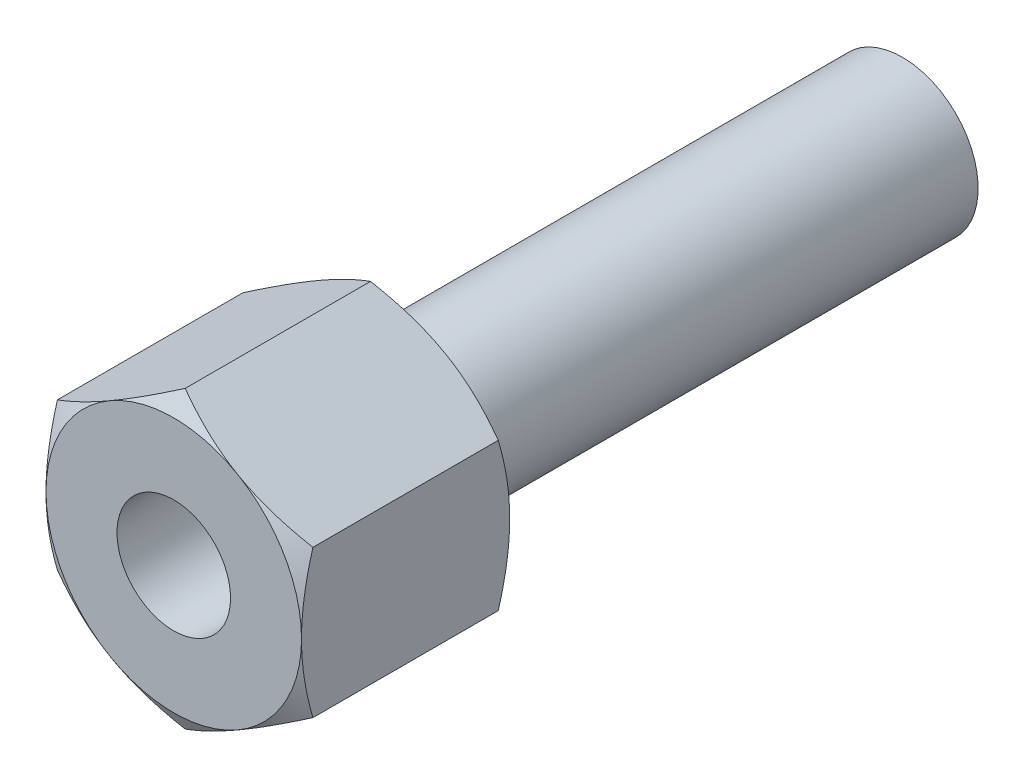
ISO-10303-21;
HEADER;
FILE_DESCRIPTION(('STEP AP214'),'2;1');
FILE_NAME('part.step','',(''),(''),'','','');
FILE_SCHEMA(('AUTOMOTIVE_DESIGN { 1 0 10303 214 1 1 1 1 }'));
ENDSEC;
DATA;
#1=APPLICATION_CONTEXT('core data for automotive mechanical design processes');
#2=APPLICATION_PROTOCOL_DEFINITION('international standard','automotive_design',2000,#1);
#3=PRODUCT_CONTEXT('',#1,'mechanical');
#4=PRODUCT('Part','Part','',(#3));
#5=PRODUCT_RELATED_PRODUCT_CATEGORY('part','',(#4));
#6=PRODUCT_DEFINITION_FORMATION('','',#4);
#7=PRODUCT_DEFINITION_CONTEXT('part definition',#1,'design');
#8=PRODUCT_DEFINITION('design','',#6,#7);
#9=PRODUCT_DEFINITION_SHAPE('','',#8);
#10=(LENGTH_UNIT() NAMED_UNIT(*) SI_UNIT(.MILLI.,.METRE.));
#11=(NAMED_UNIT(*) PLANE_ANGLE_UNIT() SI_UNIT($,.RADIAN.));
#12=(NAMED_UNIT(*) SI_UNIT($,.STERADIAN.) SOLID_ANGLE_UNIT());
#13=UNCERTAINTY_MEASURE_WITH_UNIT(LENGTH_MEASURE(1.E-05),#10,'distance_accuracy_value','');
#14=(GEOMETRIC_REPRESENTATION_CONTEXT(3) GLOBAL_UNCERTAINTY_ASSIGNED_CONTEXT((#13)) GLOBAL_UNIT_ASSIGNED_CONTEXT((#10,
#11,#12)) REPRESENTATION_CONTEXT('',''));
#15=CARTESIAN_POINT('',(0.,0.,0.));
#16=DIRECTION('',(0.,0.,1.));
#17=DIRECTION('',(1.,0.,0.));
#18=AXIS2_PLACEMENT_3D('',#15,#16,#17);
#19=CARTESIAN_POINT('',(0.,15.5884572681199,22.));
#20=DIRECTION('',(0.5,-0.866025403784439,0.));
#21=DIRECTION('',(0.866025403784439,0.5,0.));
#22=AXIS2_PLACEMENT_3D('',#19,#20,#21);
#23=PLANE('',#22);
#24=CARTESIAN_POINT('',(-13.5002,7.79411316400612,1.20583803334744));
#25=CARTESIAN_POINT('',(-13.2034751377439,7.9654273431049,1.10693600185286));
#26=CARTESIAN_POINT('',(-12.9055928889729,8.13740973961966,1.01252193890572));
#27=CARTESIAN_POINT('',(-12.3074397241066,8.48275363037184,0.833917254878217));
#28=CARTESIAN_POINT('',(-12.0071680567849,8.65611555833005,0.749729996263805));
#29=CARTESIAN_POINT('',(-11.403655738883,9.00455355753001,0.592710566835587));
#30=CARTESIAN_POINT('',(-11.1004098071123,9.17963267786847,0.51990526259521));
#31=CARTESIAN_POINT('',(-10.4918107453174,9.53100751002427,0.387213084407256));
#32=CARTESIAN_POINT('',(-10.1864577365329,9.70730315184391,0.327325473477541));
#33=CARTESIAN_POINT('',(-9.58146884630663,10.0565936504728,0.22301591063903));
#34=CARTESIAN_POINT('',(-9.28187788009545,10.2295625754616,0.178248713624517));
#35=CARTESIAN_POINT('',(-8.68132315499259,10.5762930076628,0.10318393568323));
#36=CARTESIAN_POINT('',(-8.38035936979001,10.7500545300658,0.0728866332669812));
#37=CARTESIAN_POINT('',(-7.77792621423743,11.0978694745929,0.0275266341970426));
#38=CARTESIAN_POINT('',(-7.47645787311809,11.2719223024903,0.0124458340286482));
#39=CARTESIAN_POINT('',(-6.87324289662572,11.6201886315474,-0.00215683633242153));
#40=CARTESIAN_POINT('',(-6.57149627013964,11.7944021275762,-0.00167918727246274));
#41=CARTESIAN_POINT('',(-6.00738189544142,12.1200937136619,0.0137483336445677));
#42=CARTESIAN_POINT('',(-5.74497394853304,12.271595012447,0.0268164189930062));
#43=CARTESIAN_POINT('',(-5.22076165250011,12.5742491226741,0.0644725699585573));
#44=CARTESIAN_POINT('',(-4.95895734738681,12.7254019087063,0.0890614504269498));
#45=CARTESIAN_POINT('',(-4.43609453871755,13.0272768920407,0.149330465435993));
#46=CARTESIAN_POINT('',(-4.17503683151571,13.1779986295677,0.185019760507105));
#47=CARTESIAN_POINT('',(-3.65414530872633,13.4787354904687,0.2668634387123));
#48=CARTESIAN_POINT('',(-3.39431157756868,13.6287505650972,0.313018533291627));
#49=CARTESIAN_POINT('',(-2.60557180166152,14.0841296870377,0.468349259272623));
#50=CARTESIAN_POINT('',(-2.07894982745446,14.3881750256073,0.593013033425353));
#51=CARTESIAN_POINT('',(-1.03355849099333,14.9917319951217,0.875948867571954));
#52=CARTESIAN_POINT('',(-0.514775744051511,15.2912513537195,1.03415447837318));
#53=CARTESIAN_POINT('',(0.00020000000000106,15.5885727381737,1.20583803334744));
#54=B_SPLINE_CURVE_WITH_KNOTS('',3,(#24,#25,#26,#27,#28,#29,#30,#31,#32,#33,#34,#35,#36,#37,#38,
#39,#40,#41,#42,#43,#44,#45,#46,#47,#48,#49,#50,#51,#52,#53),.UNSPECIFIED.,.F.,.F.,(4,2,2,2,2,2,
2,2,2,2,2,2,2,2,4),(0.,1.0698794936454,2.14010980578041,3.21282939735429,4.28548777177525,
5.33167033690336,6.37787303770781,7.42282956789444,8.46775380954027,9.377387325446,
10.2870851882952,11.1975357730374,12.1080482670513,13.9691139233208,15.8265265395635),.UNSPECIFIED.);
#55=CARTESIAN_POINT('',(-13.5,7.79422863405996,1.20577136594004));
#56=VERTEX_POINT('',#55);
#57=CARTESIAN_POINT('',(-6.75,11.6913429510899,0.));
#58=VERTEX_POINT('',#57);
#59=EDGE_CURVE('E135',#56,#58,#54,.T.);
#60=ORIENTED_EDGE('',*,*,#59,.F.);
#61=DIRECTION('',(0.,0.,-1.));
#62=VECTOR('',#61,1.);
#63=CARTESIAN_POINT('',(-13.5,7.79422863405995,22.));
#64=LINE('',#63,#62);
#65=CARTESIAN_POINT('',(-13.5,7.79422863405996,20.79422863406));
#66=VERTEX_POINT('',#65);
#67=EDGE_CURVE('E262',#66,#56,#64,.T.);
#68=ORIENTED_EDGE('',*,*,#67,.F.);
#69=CARTESIAN_POINT('',(0.0002,15.5885727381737,20.7941619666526));
#70=CARTESIAN_POINT('',(-0.296524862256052,15.417258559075,20.8930639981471));
#71=CARTESIAN_POINT('',(-0.594407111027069,15.2452761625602,20.9874780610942));
#72=CARTESIAN_POINT('',(-1.19256027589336,14.899932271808,21.1660827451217));
#73=CARTESIAN_POINT('',(-1.49283194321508,14.7265703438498,21.2502700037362));
#74=CARTESIAN_POINT('',(-2.09634426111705,14.3781323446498,21.4072894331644));
#75=CARTESIAN_POINT('',(-2.39959019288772,14.2030532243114,21.4800947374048));
#76=CARTESIAN_POINT('',(-3.00818925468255,13.8516783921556,21.6127869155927));
#77=CARTESIAN_POINT('',(-3.31354226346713,13.675382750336,21.6726745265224));
#78=CARTESIAN_POINT('',(-3.91853115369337,13.3260922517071,21.7769840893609));
#79=CARTESIAN_POINT('',(-4.21812211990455,13.1531233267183,21.8217512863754));
#80=CARTESIAN_POINT('',(-4.81867684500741,12.8063928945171,21.8968160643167));
#81=CARTESIAN_POINT('',(-5.11964063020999,12.632631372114,21.927113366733));
#82=CARTESIAN_POINT('',(-5.72207378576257,12.284816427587,21.9724733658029));
#83=CARTESIAN_POINT('',(-6.02354212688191,12.1107635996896,21.9875541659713));
#84=CARTESIAN_POINT('',(-6.62675710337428,11.7624972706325,22.0021568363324));
#85=CARTESIAN_POINT('',(-6.92850372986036,11.5882837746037,22.0016791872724));
#86=CARTESIAN_POINT('',(-7.49261810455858,11.262592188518,21.9862516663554));
#87=CARTESIAN_POINT('',(-7.75502605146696,11.1110908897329,21.973183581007));
#88=CARTESIAN_POINT('',(-8.27923834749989,10.8084367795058,21.9355274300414));
#89=CARTESIAN_POINT('',(-8.54104265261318,10.6572839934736,21.910938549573));
#90=CARTESIAN_POINT('',(-9.06390546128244,10.3554090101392,21.850669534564));
#91=CARTESIAN_POINT('',(-9.32496316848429,10.2046872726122,21.8149802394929));
#92=CARTESIAN_POINT('',(-9.84585469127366,9.90395041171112,21.7331365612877));
#93=CARTESIAN_POINT('',(-10.1056884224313,9.7539353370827,21.6869814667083));
#94=CARTESIAN_POINT('',(-10.8944281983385,9.29855621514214,21.5316507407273));
#95=CARTESIAN_POINT('',(-11.4210501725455,8.99451087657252,21.4069869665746));
#96=CARTESIAN_POINT('',(-12.4664415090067,8.39095390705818,21.124051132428));
#97=CARTESIAN_POINT('',(-12.9852242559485,8.09143454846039,20.9658455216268));
#98=CARTESIAN_POINT('',(-13.5002,7.79411316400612,20.7941619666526));
#99=B_SPLINE_CURVE_WITH_KNOTS('',3,(#69,#70,#71,#72,#73,#74,#75,#76,#77,#78,#79,#80,#81,#82,#83,
#84,#85,#86,#87,#88,#89,#90,#91,#92,#93,#94,#95,#96,#97,#98),.UNSPECIFIED.,.F.,.F.,(4,2,2,2,2,2,
2,2,2,2,2,2,2,2,4),(0.,1.0698794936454,2.14010980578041,3.21282939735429,4.28548777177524,
5.33167033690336,6.37787303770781,7.42282956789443,8.46775380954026,9.37738732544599,
10.2870851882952,11.1975357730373,12.1080482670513,13.9691139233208,15.8265265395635),.UNSPECIFIED.);
#100=CARTESIAN_POINT('',(-6.75,11.6913429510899,22.));
#101=VERTEX_POINT('',#100);
#102=EDGE_CURVE('E197',#101,#66,#99,.T.);
#103=ORIENTED_EDGE('',*,*,#102,.F.);
#104=CARTESIAN_POINT('',(0.,15.5884572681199,20.79422863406));
#105=VERTEX_POINT('',#104);
#106=EDGE_CURVE('E225',#105,#101,#99,.T.);
#107=ORIENTED_EDGE('',*,*,#106,.F.);
#108=DIRECTION('',(0.,0.,-1.));
#109=VECTOR('',#108,1.);
#110=CARTESIAN_POINT('',(0.,15.5884572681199,22.));
#111=LINE('',#110,#109);
#112=CARTESIAN_POINT('',(0.,15.5884572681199,1.20577136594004));
#113=VERTEX_POINT('',#112);
#114=EDGE_CURVE('E251',#105,#113,#111,.T.);
#115=ORIENTED_EDGE('',*,*,#114,.T.);
#116=EDGE_CURVE('E128',#58,#113,#54,.T.);
#117=ORIENTED_EDGE('',*,*,#116,.F.);
#118=EDGE_LOOP('',(#60,#68,#103,#107,#115,#117));
#119=FACE_BOUND('',#118,.T.);
#120=ADVANCED_FACE('F14',(#119),#23,.F.);
#121=CARTESIAN_POINT('',(-13.5,7.79422863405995,22.));
#122=DIRECTION('',(1.,0.,0.));
#123=DIRECTION('',(0.,0.,-1.));
#124=AXIS2_PLACEMENT_3D('',#121,#122,#123);
#125=PLANE('',#124);
#126=CARTESIAN_POINT('',(-13.5,-21.0567295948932,6.64686852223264));
#127=CARTESIAN_POINT('',(-13.5,-20.76141971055,6.50333975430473));
#128=CARTESIAN_POINT('',(-13.5,-20.4657665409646,6.36051762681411));
#129=CARTESIAN_POINT('',(-13.5,-19.8737020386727,6.07644645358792));
#130=CARTESIAN_POINT('',(-13.5,-19.5772906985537,5.93519742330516));
#131=CARTESIAN_POINT('',(-13.5,-18.6867347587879,5.51401322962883));
#132=CARTESIAN_POINT('',(-13.5,-18.0913537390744,5.23668263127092));
#133=CARTESIAN_POINT('',(-13.5,-16.8934647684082,4.68915362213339));
#134=CARTESIAN_POINT('',(-13.5,-16.290935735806,4.41900122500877));
#135=CARTESIAN_POINT('',(-13.5,-15.0811281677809,3.88958730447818));
#136=CARTESIAN_POINT('',(-13.5,-14.4738498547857,3.63032527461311));
#137=CARTESIAN_POINT('',(-13.5,-13.2334872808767,3.11725951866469));
#138=CARTESIAN_POINT('',(-13.5,-12.6002115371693,2.8639163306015));
#139=CARTESIAN_POINT('',(-13.5,-11.3262912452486,2.37611278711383));
#140=CARTESIAN_POINT('',(-13.5,-10.6856458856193,2.14165453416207));
#141=CARTESIAN_POINT('',(-13.5,-9.39714853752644,1.69769156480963));
#142=CARTESIAN_POINT('',(-13.5,-8.74931374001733,1.48813735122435));
#143=CARTESIAN_POINT('',(-13.5,-7.44429059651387,1.10061474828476));
#144=CARTESIAN_POINT('',(-13.5,-6.78710522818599,0.922636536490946));
#145=CARTESIAN_POINT('',(-13.5,-5.79602156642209,0.686222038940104));
#146=CARTESIAN_POINT('',(-13.5,-5.46570727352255,0.612672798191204));
#147=CARTESIAN_POINT('',(-13.5,-4.8027995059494,0.476621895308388));
#148=CARTESIAN_POINT('',(-13.5,-4.47020607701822,0.414120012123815));
#149=CARTESIAN_POINT('',(-13.5,-3.80296053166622,0.301259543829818));
#150=CARTESIAN_POINT('',(-13.5,-3.4683084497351,0.250900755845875));
#151=CARTESIAN_POINT('',(-13.5,-2.7972903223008,0.163326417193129));
#152=CARTESIAN_POINT('',(-13.5,-2.46092434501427,0.12611034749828));
#153=CARTESIAN_POINT('',(-13.5,-1.79139242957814,0.0660341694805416));
#154=CARTESIAN_POINT('',(-13.5,-1.45824305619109,0.0429905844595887));
#155=CARTESIAN_POINT('',(-13.5,-0.791268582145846,0.0110189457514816));
#156=CARTESIAN_POINT('',(-13.5,-0.457443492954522,0.00209065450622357));
#157=CARTESIAN_POINT('',(-13.5,0.210285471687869,-0.00143754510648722));
#158=CARTESIAN_POINT('',(-13.5,0.544189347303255,0.00396257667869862));
#159=CARTESIAN_POINT('',(-13.5,1.21146913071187,0.0289579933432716));
#160=CARTESIAN_POINT('',(-13.5,1.54484501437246,0.0485539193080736));
#161=CARTESIAN_POINT('',(-13.5,2.34243421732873,0.111999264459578));
#162=CARTESIAN_POINT('',(-13.5,2.80613715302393,0.162382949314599));
#163=CARTESIAN_POINT('',(-13.5,3.73018327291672,0.287899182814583));
#164=CARTESIAN_POINT('',(-13.5,4.19052600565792,0.363034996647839));
#165=CARTESIAN_POINT('',(-13.5,5.1073852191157,0.535382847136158));
#166=CARTESIAN_POINT('',(-13.5,5.5638984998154,0.632611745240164));
#167=CARTESIAN_POINT('',(-13.5,6.47238584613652,0.846171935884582));
#168=CARTESIAN_POINT('',(-13.5,6.92435997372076,0.962502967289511));
#169=CARTESIAN_POINT('',(-13.5,7.83377493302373,1.21419730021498));
#170=CARTESIAN_POINT('',(-13.5,8.29111385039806,1.34992628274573));
#171=CARTESIAN_POINT('',(-13.5,9.20128820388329,1.63564966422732));
#172=CARTESIAN_POINT('',(-13.5,9.65412360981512,1.7856441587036));
#173=CARTESIAN_POINT('',(-13.5,10.5555104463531,2.09749590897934));
#174=CARTESIAN_POINT('',(-13.5,11.004063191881,2.25934938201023));
#175=CARTESIAN_POINT('',(-13.5,11.8974359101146,2.59299128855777));
#176=CARTESIAN_POINT('',(-13.5,12.3422559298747,2.76477959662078));
#177=CARTESIAN_POINT('',(-13.5,13.4044984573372,3.18648515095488));
#178=CARTESIAN_POINT('',(-13.5,14.0203518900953,3.44034916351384));
#179=CARTESIAN_POINT('',(-13.5,15.2466947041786,3.96075653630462));
#180=CARTESIAN_POINT('',(-13.5,15.8571837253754,4.22730074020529));
#181=CARTESIAN_POINT('',(-13.5,17.0738155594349,4.77048959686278));
#182=CARTESIAN_POINT('',(-13.5,17.6799572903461,5.04713666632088));
#183=CARTESIAN_POINT('',(-13.5,18.8884850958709,5.60845922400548));
#184=CARTESIAN_POINT('',(-13.5,19.4908712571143,5.89313452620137));
#185=CARTESIAN_POINT('',(-13.5,20.6932151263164,6.46932231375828));
#186=CARTESIAN_POINT('',(-13.5,21.2931692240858,6.76084231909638));
#187=CARTESIAN_POINT('',(-13.5,22.4904551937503,7.34921758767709));
#188=CARTESIAN_POINT('',(-13.5,23.0877870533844,7.64607287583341));
#189=CARTESIAN_POINT('',(-13.5,24.2801545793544,8.24414991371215));
#190=CARTESIAN_POINT('',(-13.5,24.8751905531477,8.54537105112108));
#191=CARTESIAN_POINT('',(-13.5,26.0633848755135,9.15149610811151));
#192=CARTESIAN_POINT('',(-13.5,26.6565432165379,9.45640004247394));
#193=CARTESIAN_POINT('',(-13.5,28.3317379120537,10.323032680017));
#194=CARTESIAN_POINT('',(-13.5,29.411904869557,10.8883747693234));
#195=CARTESIAN_POINT('',(-13.5,31.5682242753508,12.0267442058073));
#196=CARTESIAN_POINT('',(-13.5,32.6443765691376,12.5997718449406));
#197=CARTESIAN_POINT('',(-13.5,34.7907289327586,13.7501918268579));
#198=CARTESIAN_POINT('',(-13.5,35.8609372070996,14.32756887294));
#199=CARTESIAN_POINT('',(-13.5,37.4643622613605,15.1970374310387));
#200=CARTESIAN_POINT('',(-13.5,37.9985075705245,15.4874191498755));
#201=CARTESIAN_POINT('',(-13.5,39.0662412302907,16.0692028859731));
#202=CARTESIAN_POINT('',(-13.5,39.5998295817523,16.3606049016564));
#203=CARTESIAN_POINT('',(-13.5,40.1331712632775,16.6524578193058));
#204=B_SPLINE_CURVE_WITH_KNOTS('',3,(#126,#127,#128,#129,#130,#131,#132,#133,#134,#135,#136,
#137,#138,#139,#140,#141,#142,#143,#144,#145,#146,#147,#148,#149,#150,#151,#152,#153,#154,#155,
#156,#157,#158,#159,#160,#161,#162,#163,#164,#165,#166,#167,#168,#169,#170,#171,#172,#173,#174,
#175,#176,#177,#178,#179,#180,#181,#182,#183,#184,#185,#186,#187,#188,#189,#190,#191,#192,#193,
#194,#195,#196,#197,#198,#199,#200,#201,#202,#203),.UNSPECIFIED.,.F.,.F.,(4,2,2,2,2,2,2,2,2,2,2,
2,2,2,2,2,2,2,2,2,2,2,2,2,2,2,2,2,2,2,2,2,2,2,2,2,2,2,4),(0.,0.985024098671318,1.97005786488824,
3.94041071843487,5.92128906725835,7.90207519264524,9.94805838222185,11.9942690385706,
14.036342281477,16.0777791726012,17.092835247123,18.1078710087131,19.12288981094,
20.1378685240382,21.1394144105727,22.1409434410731,23.1424745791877,24.1440502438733,
25.5425754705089,26.9412852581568,28.3410661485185,29.7408279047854,31.1717145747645,
32.6026108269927,34.0330526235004,35.4634763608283,37.4616565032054,39.4599697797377,
41.4587642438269,43.4575124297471,45.4585700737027,47.4596370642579,49.4604260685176,
51.4612231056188,55.11868221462,58.7762806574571,62.4243321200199,64.2482542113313,
66.0721734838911),.UNSPECIFIED.);
#205=CARTESIAN_POINT('',(-13.5,-7.79422863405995,1.20577136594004));
#206=VERTEX_POINT('',#205);
#207=CARTESIAN_POINT('',(-13.5,0.,0.));
#208=VERTEX_POINT('',#207);
#209=EDGE_CURVE('E333',#206,#208,#204,.T.);
#210=ORIENTED_EDGE('',*,*,#209,.F.);
#211=DIRECTION('',(0.,0.,-1.));
#212=VECTOR('',#211,1.);
#213=CARTESIAN_POINT('',(-13.5,-7.79422863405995,22.));
#214=LINE('',#213,#212);
#215=CARTESIAN_POINT('',(-13.5,-7.79422863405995,20.79422863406));
#216=VERTEX_POINT('',#215);
#217=EDGE_CURVE('E265',#216,#206,#214,.T.);
#218=ORIENTED_EDGE('',*,*,#217,.F.);
#219=CARTESIAN_POINT('',(-13.5,-21.0567295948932,15.3531314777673));
#220=CARTESIAN_POINT('',(-13.5,-20.76141971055,15.4966602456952));
#221=CARTESIAN_POINT('',(-13.5,-20.4657665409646,15.6394823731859));
#222=CARTESIAN_POINT('',(-13.5,-19.8737020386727,15.923553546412));
#223=CARTESIAN_POINT('',(-13.5,-19.5772906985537,16.0648025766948));
#224=CARTESIAN_POINT('',(-13.5,-18.6867347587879,16.4859867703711));
#225=CARTESIAN_POINT('',(-13.5,-18.0913537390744,16.763317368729));
#226=CARTESIAN_POINT('',(-13.5,-16.8934647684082,17.3108463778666));
#227=CARTESIAN_POINT('',(-13.5,-16.290935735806,17.5809987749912));
#228=CARTESIAN_POINT('',(-13.5,-15.0811281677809,18.1104126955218));
#229=CARTESIAN_POINT('',(-13.5,-14.4738498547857,18.3696747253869));
#230=CARTESIAN_POINT('',(-13.5,-13.2334872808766,18.8827404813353));
#231=CARTESIAN_POINT('',(-13.5,-12.6002115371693,19.1360836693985));
#232=CARTESIAN_POINT('',(-13.5,-11.3262912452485,19.6238872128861));
#233=CARTESIAN_POINT('',(-13.5,-10.6856458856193,19.8583454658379));
#234=CARTESIAN_POINT('',(-13.5,-9.39714853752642,20.3023084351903));
#235=CARTESIAN_POINT('',(-13.5,-8.74931374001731,20.5118626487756));
#236=CARTESIAN_POINT('',(-13.5,-7.44429059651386,20.8993852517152));
#237=CARTESIAN_POINT('',(-13.5,-6.78710522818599,21.0773634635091));
#238=CARTESIAN_POINT('',(-13.5,-5.79602156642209,21.3137779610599));
#239=CARTESIAN_POINT('',(-13.5,-5.46570727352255,21.3873272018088));
#240=CARTESIAN_POINT('',(-13.5,-4.80279950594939,21.5233781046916));
#241=CARTESIAN_POINT('',(-13.5,-4.47020607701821,21.5858799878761));
#242=CARTESIAN_POINT('',(-13.5,-3.80296053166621,21.6987404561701));
#243=CARTESIAN_POINT('',(-13.5,-3.46830844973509,21.7490992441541));
#244=CARTESIAN_POINT('',(-13.5,-2.79729032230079,21.8366735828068));
#245=CARTESIAN_POINT('',(-13.5,-2.46092434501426,21.8738896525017));
#246=CARTESIAN_POINT('',(-13.5,-1.79139242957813,21.9339658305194));
#247=CARTESIAN_POINT('',(-13.5,-1.45824305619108,21.9570094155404));
#248=CARTESIAN_POINT('',(-13.5,-0.791268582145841,21.9889810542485));
#249=CARTESIAN_POINT('',(-13.5,-0.457443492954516,21.9979093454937));
#250=CARTESIAN_POINT('',(-13.5,0.210285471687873,22.0014375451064));
#251=CARTESIAN_POINT('',(-13.5,0.544189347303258,21.9960374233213));
#252=CARTESIAN_POINT('',(-13.5,1.21146913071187,21.9710420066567));
#253=CARTESIAN_POINT('',(-13.5,1.54484501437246,21.9514460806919));
#254=CARTESIAN_POINT('',(-13.5,2.34243421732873,21.8880007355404));
#255=CARTESIAN_POINT('',(-13.5,2.80613715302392,21.8376170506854));
#256=CARTESIAN_POINT('',(-13.5,3.73018327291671,21.7121008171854));
#257=CARTESIAN_POINT('',(-13.5,4.1905260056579,21.6369650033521));
#258=CARTESIAN_POINT('',(-13.5,5.10738521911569,21.4646171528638));
#259=CARTESIAN_POINT('',(-13.5,5.56389849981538,21.3673882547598));
#260=CARTESIAN_POINT('',(-13.5,6.4723858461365,21.1538280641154));
#261=CARTESIAN_POINT('',(-13.5,6.92435997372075,21.0374970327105));
#262=CARTESIAN_POINT('',(-13.5,7.83377493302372,20.785802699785));
#263=CARTESIAN_POINT('',(-13.5,8.29111385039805,20.6500737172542));
#264=CARTESIAN_POINT('',(-13.5,9.20128820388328,20.3643503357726));
#265=CARTESIAN_POINT('',(-13.5,9.65412360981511,20.2143558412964));
#266=CARTESIAN_POINT('',(-13.5,10.5555104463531,19.9025040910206));
#267=CARTESIAN_POINT('',(-13.5,11.004063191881,19.7406506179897));
#268=CARTESIAN_POINT('',(-13.5,11.8974359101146,19.4070087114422));
#269=CARTESIAN_POINT('',(-13.5,12.3422559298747,19.2352204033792));
#270=CARTESIAN_POINT('',(-13.5,13.4044984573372,18.8135148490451));
#271=CARTESIAN_POINT('',(-13.5,14.0203518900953,18.5596508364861));
#272=CARTESIAN_POINT('',(-13.5,15.2466947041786,18.0392434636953));
#273=CARTESIAN_POINT('',(-13.5,15.8571837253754,17.7726992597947));
#274=CARTESIAN_POINT('',(-13.5,17.0738155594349,17.2295104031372));
#275=CARTESIAN_POINT('',(-13.5,17.6799572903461,16.9528633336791));
#276=CARTESIAN_POINT('',(-13.5,18.8884850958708,16.3915407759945));
#277=CARTESIAN_POINT('',(-13.5,19.4908712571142,16.1068654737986));
#278=CARTESIAN_POINT('',(-13.5,20.6932151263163,15.5306776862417));
#279=CARTESIAN_POINT('',(-13.5,21.2931692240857,15.2391576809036));
#280=CARTESIAN_POINT('',(-13.5,22.4904551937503,14.6507824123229));
#281=CARTESIAN_POINT('',(-13.5,23.0877870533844,14.3539271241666));
#282=CARTESIAN_POINT('',(-13.5,24.2801545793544,13.7558500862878));
#283=CARTESIAN_POINT('',(-13.5,24.8751905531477,13.4546289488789));
#284=CARTESIAN_POINT('',(-13.5,26.0633848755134,12.8485038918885));
#285=CARTESIAN_POINT('',(-13.5,26.6565432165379,12.543599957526));
#286=CARTESIAN_POINT('',(-13.5,28.3317379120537,11.676967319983));
#287=CARTESIAN_POINT('',(-13.5,29.411904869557,11.1116252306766));
#288=CARTESIAN_POINT('',(-13.5,31.5682242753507,9.97325579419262));
#289=CARTESIAN_POINT('',(-13.5,32.6443765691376,9.4002281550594));
#290=CARTESIAN_POINT('',(-13.5,34.7907289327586,8.24980817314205));
#291=CARTESIAN_POINT('',(-13.5,35.8609372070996,7.67243112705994));
#292=CARTESIAN_POINT('',(-13.5,37.4643622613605,6.80296256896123));
#293=CARTESIAN_POINT('',(-13.5,37.9985075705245,6.51258085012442));
#294=CARTESIAN_POINT('',(-13.5,39.0662412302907,5.93079711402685));
#295=CARTESIAN_POINT('',(-13.5,39.5998295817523,5.63939509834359));
#296=CARTESIAN_POINT('',(-13.5,40.1331712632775,5.34754218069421));
#297=B_SPLINE_CURVE_WITH_KNOTS('',3,(#219,#220,#221,#222,#223,#224,#225,#226,#227,#228,#229,
#230,#231,#232,#233,#234,#235,#236,#237,#238,#239,#240,#241,#242,#243,#244,#245,#246,#247,#248,
#249,#250,#251,#252,#253,#254,#255,#256,#257,#258,#259,#260,#261,#262,#263,#264,#265,#266,#267,
#268,#269,#270,#271,#272,#273,#274,#275,#276,#277,#278,#279,#280,#281,#282,#283,#284,#285,#286,
#287,#288,#289,#290,#291,#292,#293,#294,#295,#296),.UNSPECIFIED.,.F.,.F.,(4,2,2,2,2,2,2,2,2,2,2,
2,2,2,2,2,2,2,2,2,2,2,2,2,2,2,2,2,2,2,2,2,2,2,2,2,2,2,4),(0.,0.985024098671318,1.97005786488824,
3.94041071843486,5.92128906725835,7.90207519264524,9.94805838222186,11.9942690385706,
14.036342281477,16.0777791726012,17.092835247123,18.1078710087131,19.12288981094,
20.1378685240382,21.1394144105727,22.1409434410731,23.1424745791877,24.1440502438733,
25.5425754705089,26.9412852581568,28.3410661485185,29.7408279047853,31.1717145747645,
32.6026108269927,34.0330526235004,35.4634763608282,37.4616565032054,39.4599697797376,
41.4587642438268,43.4575124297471,45.4585700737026,47.4596370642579,49.4604260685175,
51.4612231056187,55.11868221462,58.776280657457,62.4243321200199,64.2482542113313,
66.072173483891),.UNSPECIFIED.);
#298=CARTESIAN_POINT('',(-13.5,0.,22.));
#299=VERTEX_POINT('',#298);
#300=EDGE_CURVE('E224',#299,#216,#297,.F.);
#301=ORIENTED_EDGE('',*,*,#300,.F.);
#302=EDGE_CURVE('E206',#66,#299,#297,.F.);
#303=ORIENTED_EDGE('',*,*,#302,.F.);
#304=ORIENTED_EDGE('',*,*,#67,.T.);
#305=EDGE_CURVE('E304',#208,#56,#204,.T.);
#306=ORIENTED_EDGE('',*,*,#305,.F.);
#307=EDGE_LOOP('',(#210,#218,#301,#303,#304,#306));
#308=FACE_BOUND('',#307,.T.);
#309=ADVANCED_FACE('F311',(#308),#125,.F.);
#310=CARTESIAN_POINT('',(-13.5,-7.79422863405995,22.));
#311=DIRECTION('',(0.5,0.866025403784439,0.));
#312=DIRECTION('',(-0.866025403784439,0.5,0.));
#313=AXIS2_PLACEMENT_3D('',#310,#311,#312);
#314=PLANE('',#313);
#315=CARTESIAN_POINT('',(0.000199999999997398,-15.5885727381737,1.20583803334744));
#316=CARTESIAN_POINT('',(-0.296524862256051,-15.417258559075,1.10693600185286));
#317=CARTESIAN_POINT('',(-0.594407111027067,-15.2452761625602,1.01252193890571));
#318=CARTESIAN_POINT('',(-1.19256027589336,-14.899932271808,0.833917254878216));
#319=CARTESIAN_POINT('',(-1.49283194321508,-14.7265703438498,0.749729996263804));
#320=CARTESIAN_POINT('',(-2.09634426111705,-14.3781323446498,0.592710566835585));
#321=CARTESIAN_POINT('',(-2.39959019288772,-14.2030532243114,0.519905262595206));
#322=CARTESIAN_POINT('',(-3.00818925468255,-13.8516783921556,0.387213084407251));
#323=CARTESIAN_POINT('',(-3.31354226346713,-13.6753827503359,0.327325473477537));
#324=CARTESIAN_POINT('',(-3.91853115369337,-13.3260922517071,0.223015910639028));
#325=CARTESIAN_POINT('',(-4.21812211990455,-13.1531233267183,0.178248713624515));
#326=CARTESIAN_POINT('',(-4.81867684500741,-12.8063928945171,0.103183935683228));
#327=CARTESIAN_POINT('',(-5.11964063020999,-12.632631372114,0.0728866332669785));
#328=CARTESIAN_POINT('',(-5.72207378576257,-12.284816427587,0.0275266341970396));
#329=CARTESIAN_POINT('',(-6.02354212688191,-12.1107635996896,0.0124458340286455));
#330=CARTESIAN_POINT('',(-6.62675710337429,-11.7624972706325,-0.00215683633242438));
#331=CARTESIAN_POINT('',(-6.92850372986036,-11.5882837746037,-0.00167918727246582));
#332=CARTESIAN_POINT('',(-7.49261810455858,-11.2625921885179,0.0137483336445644));
#333=CARTESIAN_POINT('',(-7.75502605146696,-11.1110908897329,0.0268164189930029));
#334=CARTESIAN_POINT('',(-8.2792383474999,-10.8084367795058,0.0644725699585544));
#335=CARTESIAN_POINT('',(-8.54104265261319,-10.6572839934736,0.0890614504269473));
#336=CARTESIAN_POINT('',(-9.06390546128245,-10.3554090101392,0.14933046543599));
#337=CARTESIAN_POINT('',(-9.3249631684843,-10.2046872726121,0.185019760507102));
#338=CARTESIAN_POINT('',(-9.84585469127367,-9.90395041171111,0.266863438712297));
#339=CARTESIAN_POINT('',(-10.1056884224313,-9.75393533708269,0.313018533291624));
#340=CARTESIAN_POINT('',(-10.8944281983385,-9.29855621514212,0.46834925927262));
#341=CARTESIAN_POINT('',(-11.4210501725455,-8.99451087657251,0.59301303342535));
#342=CARTESIAN_POINT('',(-12.4664415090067,-8.39095390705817,0.875948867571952));
#343=CARTESIAN_POINT('',(-12.9852242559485,-8.09143454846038,1.03415447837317));
#344=CARTESIAN_POINT('',(-13.5002,-7.79411316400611,1.20583803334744));
#345=B_SPLINE_CURVE_WITH_KNOTS('',3,(#315,#316,#317,#318,#319,#320,#321,#322,#323,#324,#325,
#326,#327,#328,#329,#330,#331,#332,#333,#334,#335,#336,#337,#338,#339,#340,#341,#342,#343,#344),
.UNSPECIFIED.,.F.,.F.,(4,2,2,2,2,2,2,2,2,2,2,2,2,2,4),(0.,1.06987949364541,2.14010980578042,
3.2128293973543,4.28548777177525,5.33167033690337,6.37787303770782,7.42282956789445,
8.46775380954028,9.37738732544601,10.2870851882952,11.1975357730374,12.1080482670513,
13.9691139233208,15.8265265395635),.UNSPECIFIED.);
#346=CARTESIAN_POINT('',(0.,-15.5884572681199,1.20577136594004));
#347=VERTEX_POINT('',#346);
#348=CARTESIAN_POINT('',(-6.75,-11.6913429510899,0.));
#349=VERTEX_POINT('',#348);
#350=EDGE_CURVE('E294',#347,#349,#345,.T.);
#351=ORIENTED_EDGE('',*,*,#350,.F.);
#352=DIRECTION('',(0.,0.,-1.));
#353=VECTOR('',#352,1.);
#354=CARTESIAN_POINT('',(0.,-15.5884572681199,22.));
#355=LINE('',#354,#353);
#356=CARTESIAN_POINT('',(0.,-15.5884572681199,20.79422863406));
#357=VERTEX_POINT('',#356);
#358=EDGE_CURVE('E270',#357,#347,#355,.T.);
#359=ORIENTED_EDGE('',*,*,#358,.F.);
#360=CARTESIAN_POINT('',(-13.5002,-7.79411316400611,20.7941619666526));
#361=CARTESIAN_POINT('',(-13.2034751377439,-7.9654273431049,20.8930639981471));
#362=CARTESIAN_POINT('',(-12.9055928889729,-8.13740973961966,20.9874780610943));
#363=CARTESIAN_POINT('',(-12.3074397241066,-8.48275363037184,21.1660827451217));
#364=CARTESIAN_POINT('',(-12.0071680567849,-8.65611555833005,21.2502700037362));
#365=CARTESIAN_POINT('',(-11.403655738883,-9.00455355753,21.4072894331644));
#366=CARTESIAN_POINT('',(-11.1004098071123,-9.17963267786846,21.4800947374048));
#367=CARTESIAN_POINT('',(-10.4918107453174,-9.53100751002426,21.6127869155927));
#368=CARTESIAN_POINT('',(-10.1864577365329,-9.7073031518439,21.6726745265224));
#369=CARTESIAN_POINT('',(-9.58146884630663,-10.0565936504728,21.7769840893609));
#370=CARTESIAN_POINT('',(-9.28187788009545,-10.2295625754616,21.8217512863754));
#371=CARTESIAN_POINT('',(-8.68132315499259,-10.5762930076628,21.8968160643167));
#372=CARTESIAN_POINT('',(-8.38035936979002,-10.7500545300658,21.927113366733));
#373=CARTESIAN_POINT('',(-7.77792621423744,-11.0978694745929,21.9724733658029));
#374=CARTESIAN_POINT('',(-7.4764578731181,-11.2719223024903,21.9875541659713));
#375=CARTESIAN_POINT('',(-6.87324289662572,-11.6201886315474,22.0021568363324));
#376=CARTESIAN_POINT('',(-6.57149627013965,-11.7944021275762,22.0016791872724));
#377=CARTESIAN_POINT('',(-6.00738189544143,-12.1200937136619,21.9862516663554));
#378=CARTESIAN_POINT('',(-5.74497394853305,-12.271595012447,21.973183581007));
#379=CARTESIAN_POINT('',(-5.22076165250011,-12.5742491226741,21.9355274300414));
#380=CARTESIAN_POINT('',(-4.95895734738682,-12.7254019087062,21.910938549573));
#381=CARTESIAN_POINT('',(-4.43609453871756,-13.0272768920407,21.850669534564));
#382=CARTESIAN_POINT('',(-4.17503683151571,-13.1779986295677,21.8149802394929));
#383=CARTESIAN_POINT('',(-3.65414530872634,-13.4787354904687,21.7331365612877));
#384=CARTESIAN_POINT('',(-3.39431157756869,-13.6287505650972,21.6869814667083));
#385=CARTESIAN_POINT('',(-2.60557180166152,-14.0841296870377,21.5316507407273));
#386=CARTESIAN_POINT('',(-2.07894982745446,-14.3881750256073,21.4069869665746));
#387=CARTESIAN_POINT('',(-1.03355849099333,-14.9917319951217,21.124051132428));
#388=CARTESIAN_POINT('',(-0.514775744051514,-15.2912513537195,20.9658455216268));
#389=CARTESIAN_POINT('',(0.000200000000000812,-15.5885727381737,20.7941619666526));
#390=B_SPLINE_CURVE_WITH_KNOTS('',3,(#360,#361,#362,#363,#364,#365,#366,#367,#368,#369,#370,
#371,#372,#373,#374,#375,#376,#377,#378,#379,#380,#381,#382,#383,#384,#385,#386,#387,#388,#389),
.UNSPECIFIED.,.F.,.F.,(4,2,2,2,2,2,2,2,2,2,2,2,2,2,4),(0.,1.0698794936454,2.14010980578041,
3.21282939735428,4.28548777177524,5.33167033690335,6.3778730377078,7.42282956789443,
8.46775380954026,9.37738732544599,10.2870851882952,11.1975357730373,12.1080482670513,
13.9691139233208,15.8265265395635),.UNSPECIFIED.);
#391=CARTESIAN_POINT('',(-6.75,-11.6913429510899,22.));
#392=VERTEX_POINT('',#391);
#393=EDGE_CURVE('E233',#392,#357,#390,.T.);
#394=ORIENTED_EDGE('',*,*,#393,.F.);
#395=EDGE_CURVE('E172',#216,#392,#390,.T.);
#396=ORIENTED_EDGE('',*,*,#395,.F.);
#397=ORIENTED_EDGE('',*,*,#217,.T.);
#398=EDGE_CURVE('E295',#349,#206,#345,.T.);
#399=ORIENTED_EDGE('',*,*,#398,.F.);
#400=EDGE_LOOP('',(#351,#359,#394,#396,#397,#399));
#401=FACE_BOUND('',#400,.T.);
#402=ADVANCED_FACE('F291',(#401),#314,.F.);
#403=CARTESIAN_POINT('',(0.,-15.5884572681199,22.));
#404=DIRECTION('',(-0.5,0.866025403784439,0.));
#405=DIRECTION('',(-0.866025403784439,-0.5,0.));
#406=AXIS2_PLACEMENT_3D('',#403,#404,#405);
#407=PLANE('',#406);
#408=CARTESIAN_POINT('',(13.5002,-7.79411316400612,1.20583803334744));
#409=CARTESIAN_POINT('',(13.2034751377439,-7.9654273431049,1.10693600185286));
#410=CARTESIAN_POINT('',(12.9055928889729,-8.13740973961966,1.01252193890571));
#411=CARTESIAN_POINT('',(12.3074397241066,-8.48275363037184,0.833917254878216));
#412=CARTESIAN_POINT('',(12.0071680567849,-8.65611555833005,0.749729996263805));
#413=CARTESIAN_POINT('',(11.403655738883,-9.00455355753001,0.592710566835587));
#414=CARTESIAN_POINT('',(11.1004098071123,-9.17963267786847,0.51990526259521));
#415=CARTESIAN_POINT('',(10.4918107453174,-9.53100751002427,0.387213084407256));
#416=CARTESIAN_POINT('',(10.1864577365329,-9.70730315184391,0.327325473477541));
#417=CARTESIAN_POINT('',(9.58146884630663,-10.0565936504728,0.22301591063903));
#418=CARTESIAN_POINT('',(9.28187788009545,-10.2295625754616,0.178248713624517));
#419=CARTESIAN_POINT('',(8.68132315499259,-10.5762930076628,0.10318393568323));
#420=CARTESIAN_POINT('',(8.38035936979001,-10.7500545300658,0.0728866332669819));
#421=CARTESIAN_POINT('',(7.77792621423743,-11.0978694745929,0.0275266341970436));
#422=CARTESIAN_POINT('',(7.47645787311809,-11.2719223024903,0.0124458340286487));
#423=CARTESIAN_POINT('',(6.87324289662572,-11.6201886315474,-0.00215683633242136));
#424=CARTESIAN_POINT('',(6.57149627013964,-11.7944021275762,-0.00167918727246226));
#425=CARTESIAN_POINT('',(6.00738189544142,-12.1200937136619,0.0137483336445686));
#426=CARTESIAN_POINT('',(5.74497394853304,-12.271595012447,0.0268164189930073));
#427=CARTESIAN_POINT('',(5.22076165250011,-12.5742491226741,0.0644725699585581));
#428=CARTESIAN_POINT('',(4.95895734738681,-12.7254019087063,0.0890614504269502));
#429=CARTESIAN_POINT('',(4.43609453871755,-13.0272768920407,0.149330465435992));
#430=CARTESIAN_POINT('',(4.17503683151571,-13.1779986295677,0.185019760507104));
#431=CARTESIAN_POINT('',(3.65414530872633,-13.4787354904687,0.2668634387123));
#432=CARTESIAN_POINT('',(3.39431157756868,-13.6287505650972,0.313018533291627));
#433=CARTESIAN_POINT('',(2.60557180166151,-14.0841296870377,0.468349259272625));
#434=CARTESIAN_POINT('',(2.07894982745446,-14.3881750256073,0.593013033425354));
#435=CARTESIAN_POINT('',(1.03355849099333,-14.9917319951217,0.875948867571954));
#436=CARTESIAN_POINT('',(0.51477574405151,-15.2912513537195,1.03415447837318));
#437=CARTESIAN_POINT('',(-0.000200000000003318,-15.5885727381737,1.20583803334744));
#438=B_SPLINE_CURVE_WITH_KNOTS('',3,(#408,#409,#410,#411,#412,#413,#414,#415,#416,#417,#418,
#419,#420,#421,#422,#423,#424,#425,#426,#427,#428,#429,#430,#431,#432,#433,#434,#435,#436,#437),
.UNSPECIFIED.,.F.,.F.,(4,2,2,2,2,2,2,2,2,2,2,2,2,2,4),(0.,1.06987949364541,2.14010980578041,
3.21282939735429,4.28548777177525,5.33167033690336,6.37787303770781,7.42282956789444,
8.46775380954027,9.377387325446,10.2870851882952,11.1975357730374,12.1080482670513,
13.9691139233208,15.8265265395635),.UNSPECIFIED.);
#439=CARTESIAN_POINT('',(13.5,-7.79422863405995,1.20577136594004));
#440=VERTEX_POINT('',#439);
#441=CARTESIAN_POINT('',(6.75,-11.6913429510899,0.));
#442=VERTEX_POINT('',#441);
#443=EDGE_CURVE('E112',#440,#442,#438,.T.);
#444=ORIENTED_EDGE('',*,*,#443,.F.);
#445=DIRECTION('',(0.,0.,-1.));
#446=VECTOR('',#445,1.);
#447=CARTESIAN_POINT('',(13.5,-7.79422863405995,22.));
#448=LINE('',#447,#446);
#449=CARTESIAN_POINT('',(13.5,-7.79422863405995,20.79422863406));
#450=VERTEX_POINT('',#449);
#451=EDGE_CURVE('E134',#450,#440,#448,.T.);
#452=ORIENTED_EDGE('',*,*,#451,.F.);
#453=CARTESIAN_POINT('',(-0.000200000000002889,-15.5885727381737,20.7941619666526));
#454=CARTESIAN_POINT('',(0.29652486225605,-15.417258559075,20.8930639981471));
#455=CARTESIAN_POINT('',(0.594407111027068,-15.2452761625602,20.9874780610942));
#456=CARTESIAN_POINT('',(1.19256027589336,-14.899932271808,21.1660827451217));
#457=CARTESIAN_POINT('',(1.49283194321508,-14.7265703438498,21.2502700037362));
#458=CARTESIAN_POINT('',(2.09634426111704,-14.3781323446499,21.4072894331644));
#459=CARTESIAN_POINT('',(2.39959019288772,-14.2030532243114,21.4800947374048));
#460=CARTESIAN_POINT('',(3.00818925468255,-13.8516783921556,21.6127869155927));
#461=CARTESIAN_POINT('',(3.31354226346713,-13.675382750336,21.6726745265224));
#462=CARTESIAN_POINT('',(3.91853115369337,-13.3260922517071,21.7769840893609));
#463=CARTESIAN_POINT('',(4.21812211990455,-13.1531233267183,21.8217512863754));
#464=CARTESIAN_POINT('',(4.81867684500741,-12.8063928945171,21.8968160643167));
#465=CARTESIAN_POINT('',(5.11964063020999,-12.632631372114,21.927113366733));
#466=CARTESIAN_POINT('',(5.72207378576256,-12.284816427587,21.9724733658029));
#467=CARTESIAN_POINT('',(6.0235421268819,-12.1107635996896,21.9875541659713));
#468=CARTESIAN_POINT('',(6.62675710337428,-11.7624972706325,22.0021568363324));
#469=CARTESIAN_POINT('',(6.92850372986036,-11.5882837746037,22.0016791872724));
#470=CARTESIAN_POINT('',(7.49261810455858,-11.262592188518,21.9862516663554));
#471=CARTESIAN_POINT('',(7.75502605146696,-11.1110908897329,21.973183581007));
#472=CARTESIAN_POINT('',(8.27923834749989,-10.8084367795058,21.9355274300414));
#473=CARTESIAN_POINT('',(8.54104265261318,-10.6572839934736,21.910938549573));
#474=CARTESIAN_POINT('',(9.06390546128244,-10.3554090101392,21.850669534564));
#475=CARTESIAN_POINT('',(9.32496316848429,-10.2046872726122,21.8149802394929));
#476=CARTESIAN_POINT('',(9.84585469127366,-9.90395041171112,21.7331365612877));
#477=CARTESIAN_POINT('',(10.1056884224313,-9.7539353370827,21.6869814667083));
#478=CARTESIAN_POINT('',(10.8944281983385,-9.29855621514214,21.5316507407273));
#479=CARTESIAN_POINT('',(11.4210501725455,-8.99451087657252,21.4069869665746));
#480=CARTESIAN_POINT('',(12.4664415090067,-8.39095390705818,21.124051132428));
#481=CARTESIAN_POINT('',(12.9852242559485,-8.09143454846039,20.9658455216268));
#482=CARTESIAN_POINT('',(13.5002,-7.79411316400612,20.7941619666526));
#483=B_SPLINE_CURVE_WITH_KNOTS('',3,(#453,#454,#455,#456,#457,#458,#459,#460,#461,#462,#463,
#464,#465,#466,#467,#468,#469,#470,#471,#472,#473,#474,#475,#476,#477,#478,#479,#480,#481,#482),
.UNSPECIFIED.,.F.,.F.,(4,2,2,2,2,2,2,2,2,2,2,2,2,2,4),(0.,1.0698794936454,2.14010980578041,
3.21282939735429,4.28548777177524,5.33167033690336,6.37787303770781,7.42282956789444,
8.46775380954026,9.37738732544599,10.2870851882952,11.1975357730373,12.1080482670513,
13.9691139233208,15.8265265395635),.UNSPECIFIED.);
#484=CARTESIAN_POINT('',(6.75,-11.6913429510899,22.));
#485=VERTEX_POINT('',#484);
#486=EDGE_CURVE('E178',#485,#450,#483,.T.);
#487=ORIENTED_EDGE('',*,*,#486,.F.);
#488=EDGE_CURVE('E237',#357,#485,#483,.T.);
#489=ORIENTED_EDGE('',*,*,#488,.F.);
#490=ORIENTED_EDGE('',*,*,#358,.T.);
#491=EDGE_CURVE('E298',#442,#347,#438,.T.);
#492=ORIENTED_EDGE('',*,*,#491,.F.);
#493=EDGE_LOOP('',(#444,#452,#487,#489,#490,#492));
#494=FACE_BOUND('',#493,.T.);
#495=ADVANCED_FACE('F157',(#494),#407,.F.);
#496=CARTESIAN_POINT('',(13.5,-7.79422863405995,22.));
#497=DIRECTION('',(-1.,0.,0.));
#498=DIRECTION('',(0.,-1.,0.));
#499=AXIS2_PLACEMENT_3D('',#496,#497,#498);
#500=PLANE('',#499);
#501=CARTESIAN_POINT('',(13.5,-21.0567295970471,6.64686852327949));
#502=CARTESIAN_POINT('',(13.5,-20.7614197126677,6.50333975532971));
#503=CARTESIAN_POINT('',(13.5,-20.465766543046,6.36051762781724));
#504=CARTESIAN_POINT('',(13.5,-19.8737020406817,6.07644645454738));
#505=CARTESIAN_POINT('',(13.5,-19.5772907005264,5.93519742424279));
#506=CARTESIAN_POINT('',(13.5,-18.6867347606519,5.51401323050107));
#507=CARTESIAN_POINT('',(13.5,-18.0913537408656,5.23668263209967));
#508=CARTESIAN_POINT('',(13.5,-16.893464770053,4.68915362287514));
#509=CARTESIAN_POINT('',(13.5,-16.2909357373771,4.419001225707));
#510=CARTESIAN_POINT('',(13.5,-15.0811281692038,3.88958730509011));
#511=CARTESIAN_POINT('',(13.5,-14.4738498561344,3.63032527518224));
#512=CARTESIAN_POINT('',(13.5,-13.233487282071,3.11725951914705));
#513=CARTESIAN_POINT('',(13.5,-12.6002115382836,2.86391633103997));
#514=CARTESIAN_POINT('',(13.5,-11.3262912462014,2.37611278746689));
#515=CARTESIAN_POINT('',(13.5,-10.6856458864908,2.14165453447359));
#516=CARTESIAN_POINT('',(13.5,-9.39714853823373,1.69769156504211));
#517=CARTESIAN_POINT('',(13.5,-8.74931374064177,1.48813735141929));
#518=CARTESIAN_POINT('',(13.5,-7.44429059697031,1.10061474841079));
#519=CARTESIAN_POINT('',(13.5,-6.78710522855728,0.922636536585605));
#520=CARTESIAN_POINT('',(13.5,-5.79602156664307,0.686222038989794));
#521=CARTESIAN_POINT('',(13.5,-5.4657072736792,0.612672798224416));
#522=CARTESIAN_POINT('',(13.5,-4.80279950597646,0.476621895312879));
#523=CARTESIAN_POINT('',(13.5,-4.47020607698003,0.414120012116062));
#524=CARTESIAN_POINT('',(13.5,-3.80296053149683,0.301259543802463));
#525=CARTESIAN_POINT('',(13.5,-3.46830844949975,0.250900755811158));
#526=CARTESIAN_POINT('',(13.5,-2.79729032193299,0.163326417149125));
#527=CARTESIAN_POINT('',(13.5,-2.46092434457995,0.126110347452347));
#528=CARTESIAN_POINT('',(13.5,-1.79139242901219,0.0660341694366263));
#529=CARTESIAN_POINT('',(13.5,-1.45824305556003,0.0429905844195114));
#530=CARTESIAN_POINT('',(13.5,-0.791268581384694,0.0110189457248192));
#531=CARTESIAN_POINT('',(13.5,-0.457443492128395,0.00209065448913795));
#532=CARTESIAN_POINT('',(13.5,0.21028547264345,-0.00143754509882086));
#533=CARTESIAN_POINT('',(13.5,0.544189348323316,0.00396257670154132));
#534=CARTESIAN_POINT('',(13.5,1.21146913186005,0.0289579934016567));
#535=CARTESIAN_POINT('',(13.5,1.54484501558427,0.0485539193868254));
#536=CARTESIAN_POINT('',(13.5,2.34243421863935,0.11199926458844));
#537=CARTESIAN_POINT('',(13.5,2.80613715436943,0.162382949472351));
#538=CARTESIAN_POINT('',(13.5,3.73018327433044,0.287899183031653));
#539=CARTESIAN_POINT('',(13.5,4.19052600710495,0.363034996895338));
#540=CARTESIAN_POINT('',(13.5,5.10738522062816,0.535382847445));
#541=CARTESIAN_POINT('',(13.5,5.56389850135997,0.632611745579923));
#542=CARTESIAN_POINT('',(13.5,6.47238584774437,0.846171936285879));
#543=CARTESIAN_POINT('',(13.5,6.9243599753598,0.962502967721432));
#544=CARTESIAN_POINT('',(13.5,7.83377493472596,1.2141973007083));
#545=CARTESIAN_POINT('',(13.5,8.29111385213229,1.34992628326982));
#546=CARTESIAN_POINT('',(13.5,9.20128820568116,1.63564966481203));
#547=CARTESIAN_POINT('',(13.5,9.65412361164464,1.78564415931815));
#548=CARTESIAN_POINT('',(13.5,10.5555104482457,2.09749590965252));
#549=CARTESIAN_POINT('',(13.5,11.004063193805,2.25934938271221));
#550=CARTESIAN_POINT('',(13.5,11.8974359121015,2.59299128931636));
#551=CARTESIAN_POINT('',(13.5,12.342255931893,2.76477959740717));
#552=CARTESIAN_POINT('',(13.5,13.4044984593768,3.18648515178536));
#553=CARTESIAN_POINT('',(13.5,14.0203518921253,3.44034916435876));
#554=CARTESIAN_POINT('',(13.5,15.2466947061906,3.96075653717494));
#555=CARTESIAN_POINT('',(13.5,15.857183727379,4.22730074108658));
#556=CARTESIAN_POINT('',(13.5,17.0738155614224,4.77048959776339));
#557=CARTESIAN_POINT('',(13.5,17.6799572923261,5.04713666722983));
#558=CARTESIAN_POINT('',(13.5,18.8884850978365,5.60845922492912));
#559=CARTESIAN_POINT('',(13.5,19.4908712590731,5.89313452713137));
#560=CARTESIAN_POINT('',(13.5,20.6932151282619,6.46932231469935));
#561=CARTESIAN_POINT('',(13.5,21.2931692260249,6.76084232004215));
#562=CARTESIAN_POINT('',(13.5,22.490455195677,7.34921758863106));
#563=CARTESIAN_POINT('',(13.5,23.0877870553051,7.64607287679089));
#564=CARTESIAN_POINT('',(13.5,24.2801545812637,8.24414991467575));
#565=CARTESIAN_POINT('',(13.5,24.8751905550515,8.54537105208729));
#566=CARTESIAN_POINT('',(13.5,26.0633848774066,9.15149610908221));
#567=CARTESIAN_POINT('',(13.5,26.656543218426,9.45640004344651));
#568=CARTESIAN_POINT('',(13.5,28.3317379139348,10.3230326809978));
#569=CARTESIAN_POINT('',(13.5,29.4119048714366,10.8883747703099));
#570=CARTESIAN_POINT('',(13.5,31.5682242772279,12.0267442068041));
#571=CARTESIAN_POINT('',(13.5,32.6443765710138,12.5997718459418));
#572=CARTESIAN_POINT('',(13.5,34.7907289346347,13.7501918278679));
#573=CARTESIAN_POINT('',(13.5,35.8609372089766,14.3275688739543));
#574=CARTESIAN_POINT('',(13.5,37.4643622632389,15.1970374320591));
#575=CARTESIAN_POINT('',(13.5,37.9985075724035,15.4874191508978));
#576=CARTESIAN_POINT('',(13.5,39.0662412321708,16.0692028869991));
#577=CARTESIAN_POINT('',(13.5,39.5998295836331,16.3606049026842));
#578=CARTESIAN_POINT('',(13.5,40.1331712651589,16.6524578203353));
#579=B_SPLINE_CURVE_WITH_KNOTS('',3,(#501,#502,#503,#504,#505,#506,#507,#508,#509,#510,#511,
#512,#513,#514,#515,#516,#517,#518,#519,#520,#521,#522,#523,#524,#525,#526,#527,#528,#529,#530,
#531,#532,#533,#534,#535,#536,#537,#538,#539,#540,#541,#542,#543,#544,#545,#546,#547,#548,#549,
#550,#551,#552,#553,#554,#555,#556,#557,#558,#559,#560,#561,#562,#563,#564,#565,#566,#567,#568,
#569,#570,#571,#572,#573,#574,#575,#576,#577,#578),.UNSPECIFIED.,.F.,.F.,(4,2,2,2,2,2,2,2,2,2,2,
2,2,2,2,2,2,2,2,2,2,2,2,2,2,2,2,2,2,2,2,2,2,2,2,2,2,2,4),(0.,0.985024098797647,1.97005786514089,
3.9404107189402,5.92128906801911,7.90207519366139,9.94805838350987,11.9942690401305,
14.036342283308,16.077779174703,17.0928352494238,18.107871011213,19.1228898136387,
20.1378685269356,21.1394144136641,22.1409434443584,23.1424745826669,24.1440502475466,
25.5425754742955,26.9412852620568,28.341066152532,29.7408279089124,31.1717145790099,
32.6026108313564,34.0330526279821,35.463476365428,37.4616565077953,39.4599697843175,
41.4587642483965,43.4575124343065,45.4585700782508,47.4596370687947,49.4604260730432,
51.4612231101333,55.1186822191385,58.7762806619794,62.4243321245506,64.2482542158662,
66.0721734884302),.UNSPECIFIED.);
#580=CARTESIAN_POINT('',(13.5,7.79422863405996,1.20577136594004));
#581=VERTEX_POINT('',#580);
#582=CARTESIAN_POINT('',(13.5,0.,0.));
#583=VERTEX_POINT('',#582);
#584=EDGE_CURVE('E122',#581,#583,#579,.F.);
#585=ORIENTED_EDGE('',*,*,#584,.F.);
#586=DIRECTION('',(0.,0.,-1.));
#587=VECTOR('',#586,1.);
#588=CARTESIAN_POINT('',(13.5,7.79422863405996,22.));
#589=LINE('',#588,#587);
#590=CARTESIAN_POINT('',(13.5,7.79422863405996,20.79422863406));
#591=VERTEX_POINT('',#590);
#592=EDGE_CURVE('E253',#591,#581,#589,.T.);
#593=ORIENTED_EDGE('',*,*,#592,.F.);
#594=CARTESIAN_POINT('',(13.5,-21.0567295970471,15.3531314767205));
#595=CARTESIAN_POINT('',(13.5,-20.7614197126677,15.4966602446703));
#596=CARTESIAN_POINT('',(13.5,-20.465766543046,15.6394823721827));
#597=CARTESIAN_POINT('',(13.5,-19.8737020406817,15.9235535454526));
#598=CARTESIAN_POINT('',(13.5,-19.5772907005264,16.0648025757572));
#599=CARTESIAN_POINT('',(13.5,-18.6867347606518,16.4859867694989));
#600=CARTESIAN_POINT('',(13.5,-18.0913537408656,16.7633173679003));
#601=CARTESIAN_POINT('',(13.5,-16.893464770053,17.3108463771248));
#602=CARTESIAN_POINT('',(13.5,-16.290935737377,17.580998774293));
#603=CARTESIAN_POINT('',(13.5,-15.0811281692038,18.1104126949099));
#604=CARTESIAN_POINT('',(13.5,-14.4738498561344,18.3696747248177));
#605=CARTESIAN_POINT('',(13.5,-13.233487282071,18.8827404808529));
#606=CARTESIAN_POINT('',(13.5,-12.6002115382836,19.13608366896));
#607=CARTESIAN_POINT('',(13.5,-11.3262912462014,19.6238872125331));
#608=CARTESIAN_POINT('',(13.5,-10.6856458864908,19.8583454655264));
#609=CARTESIAN_POINT('',(13.5,-9.39714853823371,20.3023084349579));
#610=CARTESIAN_POINT('',(13.5,-8.74931374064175,20.5118626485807));
#611=CARTESIAN_POINT('',(13.5,-7.4442905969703,20.8993852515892));
#612=CARTESIAN_POINT('',(13.5,-6.78710522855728,21.0773634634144));
#613=CARTESIAN_POINT('',(13.5,-5.79602156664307,21.3137779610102));
#614=CARTESIAN_POINT('',(13.5,-5.4657072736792,21.3873272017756));
#615=CARTESIAN_POINT('',(13.5,-4.80279950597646,21.5233781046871));
#616=CARTESIAN_POINT('',(13.5,-4.47020607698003,21.5858799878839));
#617=CARTESIAN_POINT('',(13.5,-3.80296053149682,21.6987404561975));
#618=CARTESIAN_POINT('',(13.5,-3.46830844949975,21.7490992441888));
#619=CARTESIAN_POINT('',(13.5,-2.79729032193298,21.8366735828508));
#620=CARTESIAN_POINT('',(13.5,-2.46092434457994,21.8738896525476));
#621=CARTESIAN_POINT('',(13.5,-1.79139242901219,21.9339658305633));
#622=CARTESIAN_POINT('',(13.5,-1.45824305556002,21.9570094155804));
#623=CARTESIAN_POINT('',(13.5,-0.791268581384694,21.9889810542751));
#624=CARTESIAN_POINT('',(13.5,-0.457443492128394,21.9979093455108));
#625=CARTESIAN_POINT('',(13.5,0.210285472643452,22.0014375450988));
#626=CARTESIAN_POINT('',(13.5,0.544189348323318,21.9960374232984));
#627=CARTESIAN_POINT('',(13.5,1.21146913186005,21.9710420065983));
#628=CARTESIAN_POINT('',(13.5,1.54484501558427,21.9514460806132));
#629=CARTESIAN_POINT('',(13.5,2.34243421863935,21.8880007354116));
#630=CARTESIAN_POINT('',(13.5,2.80613715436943,21.8376170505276));
#631=CARTESIAN_POINT('',(13.5,3.73018327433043,21.7121008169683));
#632=CARTESIAN_POINT('',(13.5,4.19052600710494,21.6369650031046));
#633=CARTESIAN_POINT('',(13.5,5.10738522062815,21.464617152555));
#634=CARTESIAN_POINT('',(13.5,5.56389850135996,21.36738825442));
#635=CARTESIAN_POINT('',(13.5,6.47238584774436,21.1538280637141));
#636=CARTESIAN_POINT('',(13.5,6.92435997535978,21.0374970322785));
#637=CARTESIAN_POINT('',(13.5,7.83377493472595,20.7858026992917));
#638=CARTESIAN_POINT('',(13.5,8.29111385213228,20.6500737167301));
#639=CARTESIAN_POINT('',(13.5,9.20128820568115,20.3643503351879));
#640=CARTESIAN_POINT('',(13.5,9.65412361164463,20.2143558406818));
#641=CARTESIAN_POINT('',(13.5,10.5555104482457,19.9025040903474));
#642=CARTESIAN_POINT('',(13.5,11.004063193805,19.7406506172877));
#643=CARTESIAN_POINT('',(13.5,11.8974359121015,19.4070087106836));
#644=CARTESIAN_POINT('',(13.5,12.342255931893,19.2352204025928));
#645=CARTESIAN_POINT('',(13.5,13.4044984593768,18.8135148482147));
#646=CARTESIAN_POINT('',(13.5,14.0203518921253,18.5596508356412));
#647=CARTESIAN_POINT('',(13.5,15.2466947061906,18.039243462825));
#648=CARTESIAN_POINT('',(13.5,15.857183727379,17.7726992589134));
#649=CARTESIAN_POINT('',(13.5,17.0738155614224,17.2295104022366));
#650=CARTESIAN_POINT('',(13.5,17.6799572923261,16.9528633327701));
#651=CARTESIAN_POINT('',(13.5,18.8884850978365,16.3915407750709));
#652=CARTESIAN_POINT('',(13.5,19.490871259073,16.1068654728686));
#653=CARTESIAN_POINT('',(13.5,20.6932151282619,15.5306776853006));
#654=CARTESIAN_POINT('',(13.5,21.2931692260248,15.2391576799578));
#655=CARTESIAN_POINT('',(13.5,22.490455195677,14.6507824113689));
#656=CARTESIAN_POINT('',(13.5,23.0877870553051,14.3539271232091));
#657=CARTESIAN_POINT('',(13.5,24.2801545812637,13.7558500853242));
#658=CARTESIAN_POINT('',(13.5,24.8751905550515,13.4546289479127));
#659=CARTESIAN_POINT('',(13.5,26.0633848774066,12.8485038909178));
#660=CARTESIAN_POINT('',(13.5,26.656543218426,12.5435999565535));
#661=CARTESIAN_POINT('',(13.5,28.3317379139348,11.6769673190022));
#662=CARTESIAN_POINT('',(13.5,29.4119048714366,11.1116252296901));
#663=CARTESIAN_POINT('',(13.5,31.5682242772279,9.9732557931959));
#664=CARTESIAN_POINT('',(13.5,32.6443765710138,9.4002281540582));
#665=CARTESIAN_POINT('',(13.5,34.7907289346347,8.24980817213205));
#666=CARTESIAN_POINT('',(13.5,35.8609372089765,7.67243112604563));
#667=CARTESIAN_POINT('',(13.5,37.4643622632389,6.8029625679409));
#668=CARTESIAN_POINT('',(13.5,37.9985075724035,6.51258084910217));
#669=CARTESIAN_POINT('',(13.5,39.0662412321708,5.93079711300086));
#670=CARTESIAN_POINT('',(13.5,39.5998295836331,5.6393950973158));
#671=CARTESIAN_POINT('',(13.5,40.1331712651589,5.34754217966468));
#672=B_SPLINE_CURVE_WITH_KNOTS('',3,(#594,#595,#596,#597,#598,#599,#600,#601,#602,#603,#604,
#605,#606,#607,#608,#609,#610,#611,#612,#613,#614,#615,#616,#617,#618,#619,#620,#621,#622,#623,
#624,#625,#626,#627,#628,#629,#630,#631,#632,#633,#634,#635,#636,#637,#638,#639,#640,#641,#642,
#643,#644,#645,#646,#647,#648,#649,#650,#651,#652,#653,#654,#655,#656,#657,#658,#659,#660,#661,
#662,#663,#664,#665,#666,#667,#668,#669,#670,#671),.UNSPECIFIED.,.F.,.F.,(4,2,2,2,2,2,2,2,2,2,2,
2,2,2,2,2,2,2,2,2,2,2,2,2,2,2,2,2,2,2,2,2,2,2,2,2,2,2,4),(0.,0.985024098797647,1.97005786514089,
3.9404107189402,5.92128906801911,7.9020751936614,9.94805838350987,11.9942690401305,
14.036342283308,16.077779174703,17.0928352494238,18.107871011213,19.1228898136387,
20.1378685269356,21.1394144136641,22.1409434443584,23.1424745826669,24.1440502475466,
25.5425754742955,26.9412852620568,28.341066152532,29.7408279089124,31.1717145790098,
32.6026108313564,34.0330526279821,35.463476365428,37.4616565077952,39.4599697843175,
41.4587642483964,43.4575124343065,45.4585700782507,47.4596370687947,49.4604260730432,
51.4612231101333,55.1186822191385,58.7762806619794,62.4243321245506,64.2482542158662,
66.0721734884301),.UNSPECIFIED.);
#673=CARTESIAN_POINT('',(13.5,0.,22.));
#674=VERTEX_POINT('',#673);
#675=EDGE_CURVE('E164',#674,#591,#672,.T.);
#676=ORIENTED_EDGE('',*,*,#675,.F.);
#677=EDGE_CURVE('E171',#450,#674,#672,.T.);
#678=ORIENTED_EDGE('',*,*,#677,.F.);
#679=ORIENTED_EDGE('',*,*,#451,.T.);
#680=EDGE_CURVE('E110',#583,#440,#579,.F.);
#681=ORIENTED_EDGE('',*,*,#680,.F.);
#682=EDGE_LOOP('',(#585,#593,#676,#678,#679,#681));
#683=FACE_BOUND('',#682,.T.);
#684=ADVANCED_FACE('F131',(#683),#500,.F.);
#685=CARTESIAN_POINT('',(13.5,7.79422863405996,22.));
#686=DIRECTION('',(-0.5,-0.866025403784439,0.));
#687=DIRECTION('',(0.866025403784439,-0.5,0.));
#688=AXIS2_PLACEMENT_3D('',#685,#686,#687);
#689=PLANE('',#688);
#690=CARTESIAN_POINT('',(-0.000200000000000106,15.5885727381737,1.20583803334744));
#691=CARTESIAN_POINT('',(0.296524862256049,15.417258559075,1.10693600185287));
#692=CARTESIAN_POINT('',(0.594407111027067,15.2452761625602,1.01252193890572));
#693=CARTESIAN_POINT('',(1.19256027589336,14.899932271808,0.833917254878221));
#694=CARTESIAN_POINT('',(1.49283194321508,14.7265703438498,0.749729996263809));
#695=CARTESIAN_POINT('',(2.09634426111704,14.3781323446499,0.59271056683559));
#696=CARTESIAN_POINT('',(2.39959019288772,14.2030532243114,0.519905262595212));
#697=CARTESIAN_POINT('',(3.00818925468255,13.8516783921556,0.387213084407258));
#698=CARTESIAN_POINT('',(3.31354226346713,13.675382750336,0.327325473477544));
#699=CARTESIAN_POINT('',(3.91853115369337,13.3260922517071,0.223015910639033));
#700=CARTESIAN_POINT('',(4.21812211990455,13.1531233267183,0.17824871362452));
#701=CARTESIAN_POINT('',(4.81867684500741,12.8063928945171,0.103183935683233));
#702=CARTESIAN_POINT('',(5.11964063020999,12.632631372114,0.0728866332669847));
#703=CARTESIAN_POINT('',(5.72207378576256,12.284816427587,0.0275266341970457));
#704=CARTESIAN_POINT('',(6.02354212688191,12.1107635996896,0.0124458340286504));
#705=CARTESIAN_POINT('',(6.62675710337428,11.7624972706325,-0.0021568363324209));
#706=CARTESIAN_POINT('',(6.92850372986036,11.5882837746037,-0.00167918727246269));
#707=CARTESIAN_POINT('',(7.49261810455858,11.262592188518,0.0137483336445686));
#708=CARTESIAN_POINT('',(7.75502605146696,11.1110908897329,0.0268164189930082));
#709=CARTESIAN_POINT('',(8.27923834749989,10.8084367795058,0.0644725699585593));
#710=CARTESIAN_POINT('',(8.54104265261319,10.6572839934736,0.0890614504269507));
#711=CARTESIAN_POINT('',(9.06390546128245,10.3554090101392,0.149330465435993));
#712=CARTESIAN_POINT('',(9.32496316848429,10.2046872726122,0.185019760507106));
#713=CARTESIAN_POINT('',(9.84585469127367,9.90395041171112,0.266863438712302));
#714=CARTESIAN_POINT('',(10.1056884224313,9.7539353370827,0.313018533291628));
#715=CARTESIAN_POINT('',(10.8944281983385,9.29855621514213,0.468349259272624));
#716=CARTESIAN_POINT('',(11.4210501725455,8.99451087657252,0.593013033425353));
#717=CARTESIAN_POINT('',(12.4664415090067,8.39095390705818,0.875948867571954));
#718=CARTESIAN_POINT('',(12.9852242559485,8.09143454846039,1.03415447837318));
#719=CARTESIAN_POINT('',(13.5002,7.79411316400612,1.20583803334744));
#720=B_SPLINE_CURVE_WITH_KNOTS('',3,(#690,#691,#692,#693,#694,#695,#696,#697,#698,#699,#700,
#701,#702,#703,#704,#705,#706,#707,#708,#709,#710,#711,#712,#713,#714,#715,#716,#717,#718,#719),
.UNSPECIFIED.,.F.,.F.,(4,2,2,2,2,2,2,2,2,2,2,2,2,2,4),(0.,1.06987949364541,2.14010980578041,
3.21282939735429,4.28548777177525,5.33167033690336,6.37787303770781,7.42282956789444,
8.46775380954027,9.377387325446,10.2870851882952,11.1975357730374,12.1080482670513,
13.9691139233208,15.8265265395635),.UNSPECIFIED.);
#721=CARTESIAN_POINT('',(6.75,11.6913429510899,0.));
#722=VERTEX_POINT('',#721);
#723=EDGE_CURVE('E9',#113,#722,#720,.T.);
#724=ORIENTED_EDGE('',*,*,#723,.F.);
#725=ORIENTED_EDGE('',*,*,#114,.F.);
#726=CARTESIAN_POINT('',(13.5002,7.79411316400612,20.7941619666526));
#727=CARTESIAN_POINT('',(13.2034751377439,7.96542734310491,20.8930639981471));
#728=CARTESIAN_POINT('',(12.9055928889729,8.13740973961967,20.9874780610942));
#729=CARTESIAN_POINT('',(12.3074397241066,8.48275363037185,21.1660827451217));
#730=CARTESIAN_POINT('',(12.0071680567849,8.65611555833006,21.2502700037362));
#731=CARTESIAN_POINT('',(11.403655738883,9.00455355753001,21.4072894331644));
#732=CARTESIAN_POINT('',(11.1004098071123,9.17963267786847,21.4800947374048));
#733=CARTESIAN_POINT('',(10.4918107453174,9.53100751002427,21.6127869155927));
#734=CARTESIAN_POINT('',(10.1864577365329,9.70730315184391,21.6726745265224));
#735=CARTESIAN_POINT('',(9.58146884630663,10.0565936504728,21.7769840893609));
#736=CARTESIAN_POINT('',(9.28187788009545,10.2295625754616,21.8217512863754));
#737=CARTESIAN_POINT('',(8.68132315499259,10.5762930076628,21.8968160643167));
#738=CARTESIAN_POINT('',(8.38035936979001,10.7500545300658,21.927113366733));
#739=CARTESIAN_POINT('',(7.77792621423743,11.0978694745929,21.9724733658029));
#740=CARTESIAN_POINT('',(7.47645787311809,11.2719223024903,21.9875541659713));
#741=CARTESIAN_POINT('',(6.87324289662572,11.6201886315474,22.0021568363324));
#742=CARTESIAN_POINT('',(6.57149627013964,11.7944021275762,22.0016791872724));
#743=CARTESIAN_POINT('',(6.00738189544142,12.1200937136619,21.9862516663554));
#744=CARTESIAN_POINT('',(5.74497394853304,12.271595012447,21.973183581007));
#745=CARTESIAN_POINT('',(5.22076165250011,12.5742491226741,21.9355274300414));
#746=CARTESIAN_POINT('',(4.95895734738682,12.7254019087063,21.910938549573));
#747=CARTESIAN_POINT('',(4.43609453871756,13.0272768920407,21.850669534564));
#748=CARTESIAN_POINT('',(4.17503683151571,13.1779986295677,21.8149802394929));
#749=CARTESIAN_POINT('',(3.65414530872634,13.4787354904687,21.7331365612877));
#750=CARTESIAN_POINT('',(3.39431157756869,13.6287505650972,21.6869814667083));
#751=CARTESIAN_POINT('',(2.60557180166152,14.0841296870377,21.5316507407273));
#752=CARTESIAN_POINT('',(2.07894982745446,14.3881750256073,21.4069869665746));
#753=CARTESIAN_POINT('',(1.03355849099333,14.9917319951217,21.124051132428));
#754=CARTESIAN_POINT('',(0.514775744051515,15.2912513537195,20.9658455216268));
#755=CARTESIAN_POINT('',(-0.000200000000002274,15.5885727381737,20.7941619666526));
#756=B_SPLINE_CURVE_WITH_KNOTS('',3,(#726,#727,#728,#729,#730,#731,#732,#733,#734,#735,#736,
#737,#738,#739,#740,#741,#742,#743,#744,#745,#746,#747,#748,#749,#750,#751,#752,#753,#754,#755),
.UNSPECIFIED.,.F.,.F.,(4,2,2,2,2,2,2,2,2,2,2,2,2,2,4),(0.,1.0698794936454,2.14010980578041,
3.21282939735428,4.28548777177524,5.33167033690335,6.3778730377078,7.42282956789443,
8.46775380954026,9.37738732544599,10.2870851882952,11.1975357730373,12.1080482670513,
13.9691139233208,15.8265265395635),.UNSPECIFIED.);
#757=CARTESIAN_POINT('',(6.75,11.6913429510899,22.));
#758=VERTEX_POINT('',#757);
#759=EDGE_CURVE('E213',#758,#105,#756,.T.);
#760=ORIENTED_EDGE('',*,*,#759,.F.);
#761=EDGE_CURVE('E218',#591,#758,#756,.T.);
#762=ORIENTED_EDGE('',*,*,#761,.F.);
#763=ORIENTED_EDGE('',*,*,#592,.T.);
#764=EDGE_CURVE('E19',#722,#581,#720,.T.);
#765=ORIENTED_EDGE('',*,*,#764,.F.);
#766=EDGE_LOOP('',(#724,#725,#760,#762,#763,#765));
#767=FACE_BOUND('',#766,.T.);
#768=ADVANCED_FACE('F16',(#767),#689,.F.);
#769=CARTESIAN_POINT('',(0.,15.5884572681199,22.));
#770=DIRECTION('',(0.,0.,1.));
#771=DIRECTION('',(1.,0.,0.));
#772=AXIS2_PLACEMENT_3D('',#769,#770,#771);
#773=PLANE('',#772);
#774=CARTESIAN_POINT('',(0.,0.,22.));
#775=DIRECTION('',(0.,0.,1.));
#776=DIRECTION('',(1.,0.,0.));
#777=AXIS2_PLACEMENT_3D('',#774,#775,#776);
#778=CIRCLE('',#777,6.);
#779=CARTESIAN_POINT('',(6.,0.,22.));
#780=VERTEX_POINT('',#779);
#781=EDGE_CURVE('E278',#780,#780,#778,.T.);
#782=ORIENTED_EDGE('',*,*,#781,.F.);
#783=EDGE_LOOP('',(#782));
#784=FACE_BOUND('',#783,.T.);
#785=CARTESIAN_POINT('',(0.,0.,22.));
#786=DIRECTION('',(0.,0.,1.));
#787=DIRECTION('',(1.,0.,0.));
#788=AXIS2_PLACEMENT_3D('',#785,#786,#787);
#789=CIRCLE('',#788,13.5);
#790=EDGE_CURVE('E242',#485,#674,#789,.T.);
#791=ORIENTED_EDGE('',*,*,#790,.T.);
#792=CARTESIAN_POINT('',(0.,0.,22.));
#793=DIRECTION('',(0.,0.,1.));
#794=DIRECTION('',(1.,0.,0.));
#795=AXIS2_PLACEMENT_3D('',#792,#793,#794);
#796=CIRCLE('',#795,13.5);
#797=EDGE_CURVE('E248',#674,#758,#796,.T.);
#798=ORIENTED_EDGE('',*,*,#797,.T.);
#799=EDGE_CURVE('E252',#758,#101,#789,.T.);
#800=ORIENTED_EDGE('',*,*,#799,.T.);
#801=EDGE_CURVE('E527',#101,#299,#789,.T.);
#802=ORIENTED_EDGE('',*,*,#801,.T.);
#803=EDGE_CURVE('E528',#299,#392,#789,.T.);
#804=ORIENTED_EDGE('',*,*,#803,.T.);
#805=EDGE_CURVE('E250',#392,#485,#789,.T.);
#806=ORIENTED_EDGE('',*,*,#805,.T.);
#807=EDGE_LOOP('',(#791,#798,#800,#802,#804,#806));
#808=FACE_BOUND('',#807,.T.);
#809=ADVANCED_FACE('F158',(#784,#808),#773,.T.);
#810=CARTESIAN_POINT('',(5.1,0.,10.));
#811=DIRECTION('',(0.,0.,-1.));
#812=DIRECTION('',(-1.,0.,0.));
#813=AXIS2_PLACEMENT_3D('',#810,#811,#812);
#814=PLANE('',#813);
#815=CARTESIAN_POINT('',(0.,0.,10.));
#816=DIRECTION('',(0.,0.,1.));
#817=DIRECTION('',(1.,0.,0.));
#818=AXIS2_PLACEMENT_3D('',#815,#816,#817);
#819=CIRCLE('',#818,6.);
#820=CARTESIAN_POINT('',(6.,0.,10.));
#821=VERTEX_POINT('',#820);
#822=EDGE_CURVE('E275',#821,#821,#819,.T.);
#823=ORIENTED_EDGE('',*,*,#822,.T.);
#824=EDGE_LOOP('',(#823));
#825=FACE_BOUND('',#824,.T.);
#826=ADVANCED_FACE('F192',(#825),#814,.F.);
#827=CARTESIAN_POINT('',(0.,0.,22.));
#828=DIRECTION('',(0.,0.,1.));
#829=DIRECTION('',(1.,0.,0.));
#830=AXIS2_PLACEMENT_3D('',#827,#828,#829);
#831=CYLINDRICAL_SURFACE('',#830,6.);
#832=ORIENTED_EDGE('',*,*,#822,.F.);
#833=EDGE_LOOP('',(#832));
#834=FACE_BOUND('',#833,.T.);
#835=ORIENTED_EDGE('',*,*,#781,.T.);
#836=EDGE_LOOP('',(#835));
#837=FACE_BOUND('',#836,.T.);
#838=ADVANCED_FACE('F362',(#834,#837),#831,.F.);
#839=CARTESIAN_POINT('',(0.,0.,22.));
#840=DIRECTION('',(0.,0.,-1.));
#841=DIRECTION('',(-1.,0.,0.));
#842=AXIS2_PLACEMENT_3D('',#839,#840,#841);
#843=CONICAL_SURFACE('',#842,13.5,1.0471975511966);
#844=ORIENTED_EDGE('',*,*,#486,.T.);
#845=ORIENTED_EDGE('',*,*,#677,.T.);
#846=ORIENTED_EDGE('',*,*,#790,.F.);
#847=EDGE_LOOP('',(#844,#845,#846));
#848=FACE_BOUND('',#847,.T.);
#849=ADVANCED_FACE('F189',(#848),#843,.T.);
#850=ORIENTED_EDGE('',*,*,#488,.T.);
#851=ORIENTED_EDGE('',*,*,#805,.F.);
#852=ORIENTED_EDGE('',*,*,#393,.T.);
#853=EDGE_LOOP('',(#850,#851,#852));
#854=FACE_BOUND('',#853,.T.);
#855=ADVANCED_FACE('F184',(#854),#843,.T.);
#856=ORIENTED_EDGE('',*,*,#395,.T.);
#857=ORIENTED_EDGE('',*,*,#803,.F.);
#858=ORIENTED_EDGE('',*,*,#300,.T.);
#859=EDGE_LOOP('',(#856,#857,#858));
#860=FACE_BOUND('',#859,.T.);
#861=ADVANCED_FACE('F188',(#860),#843,.T.);
#862=ORIENTED_EDGE('',*,*,#302,.T.);
#863=ORIENTED_EDGE('',*,*,#801,.F.);
#864=ORIENTED_EDGE('',*,*,#102,.T.);
#865=EDGE_LOOP('',(#862,#863,#864));
#866=FACE_BOUND('',#865,.T.);
#867=ADVANCED_FACE('F191',(#866),#843,.T.);
#868=ORIENTED_EDGE('',*,*,#759,.T.);
#869=ORIENTED_EDGE('',*,*,#106,.T.);
#870=ORIENTED_EDGE('',*,*,#799,.F.);
#871=EDGE_LOOP('',(#868,#869,#870));
#872=FACE_BOUND('',#871,.T.);
#873=ADVANCED_FACE('F355',(#872),#843,.T.);
#874=ORIENTED_EDGE('',*,*,#675,.T.);
#875=ORIENTED_EDGE('',*,*,#761,.T.);
#876=ORIENTED_EDGE('',*,*,#797,.F.);
#877=EDGE_LOOP('',(#874,#875,#876));
#878=FACE_BOUND('',#877,.T.);
#879=ADVANCED_FACE('F256',(#878),#843,.T.);
#880=CARTESIAN_POINT('',(0.,0.,3.96583485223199));
#881=DIRECTION('',(0.,0.,1.));
#882=DIRECTION('',(1.,0.,0.));
#883=AXIS2_PLACEMENT_3D('',#880,#881,#882);
#884=CONICAL_SURFACE('',#883,20.3690274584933,1.0471975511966);
#885=ORIENTED_EDGE('',*,*,#584,.T.);
#886=CARTESIAN_POINT('',(0.,0.,0.));
#887=DIRECTION('',(0.,0.,1.));
#888=DIRECTION('',(1.,0.,0.));
#889=AXIS2_PLACEMENT_3D('',#886,#887,#888);
#890=CIRCLE('',#889,13.5);
#891=EDGE_CURVE('E119',#583,#722,#890,.T.);
#892=ORIENTED_EDGE('',*,*,#891,.T.);
#893=ORIENTED_EDGE('',*,*,#764,.T.);
#894=EDGE_LOOP('',(#885,#892,#893));
#895=FACE_BOUND('',#894,.T.);
#896=ADVANCED_FACE('F123',(#895),#884,.T.);
#897=ORIENTED_EDGE('',*,*,#116,.T.);
#898=ORIENTED_EDGE('',*,*,#723,.T.);
#899=EDGE_CURVE('E34',#722,#58,#890,.T.);
#900=ORIENTED_EDGE('',*,*,#899,.T.);
#901=EDGE_LOOP('',(#897,#898,#900));
#902=FACE_BOUND('',#901,.T.);
#903=ADVANCED_FACE('F348',(#902),#884,.T.);
#904=ORIENTED_EDGE('',*,*,#443,.T.);
#905=EDGE_CURVE('E106',#442,#583,#890,.T.);
#906=ORIENTED_EDGE('',*,*,#905,.T.);
#907=ORIENTED_EDGE('',*,*,#680,.T.);
#908=EDGE_LOOP('',(#904,#906,#907));
#909=FACE_BOUND('',#908,.T.);
#910=ADVANCED_FACE('F108',(#909),#884,.T.);
#911=ORIENTED_EDGE('',*,*,#350,.T.);
#912=EDGE_CURVE('E117',#349,#442,#890,.T.);
#913=ORIENTED_EDGE('',*,*,#912,.T.);
#914=ORIENTED_EDGE('',*,*,#491,.T.);
#915=EDGE_LOOP('',(#911,#913,#914));
#916=FACE_BOUND('',#915,.T.);
#917=ADVANCED_FACE('F150',(#916),#884,.T.);
#918=ORIENTED_EDGE('',*,*,#398,.T.);
#919=ORIENTED_EDGE('',*,*,#209,.T.);
#920=EDGE_CURVE('E340',#208,#349,#890,.T.);
#921=ORIENTED_EDGE('',*,*,#920,.T.);
#922=EDGE_LOOP('',(#918,#919,#921));
#923=FACE_BOUND('',#922,.T.);
#924=ADVANCED_FACE('F342',(#923),#884,.T.);
#925=ORIENTED_EDGE('',*,*,#305,.T.);
#926=ORIENTED_EDGE('',*,*,#59,.T.);
#927=EDGE_CURVE('E138',#58,#208,#890,.T.);
#928=ORIENTED_EDGE('',*,*,#927,.T.);
#929=EDGE_LOOP('',(#925,#926,#928));
#930=FACE_BOUND('',#929,.T.);
#931=ADVANCED_FACE('F339',(#930),#884,.T.);
#932=CARTESIAN_POINT('',(8.,0.,-55.));
#933=DIRECTION('',(0.,0.,1.));
#934=DIRECTION('',(1.,0.,0.));
#935=AXIS2_PLACEMENT_3D('',#932,#933,#934);
#936=PLANE('',#935);
#937=CARTESIAN_POINT('',(0.,0.,-55.));
#938=DIRECTION('',(0.,0.,-1.));
#939=DIRECTION('',(-1.,0.,0.));
#940=AXIS2_PLACEMENT_3D('',#937,#938,#939);
#941=CIRCLE('',#940,8.);
#942=CARTESIAN_POINT('',(-8.,0.,-55.));
#943=VERTEX_POINT('',#942);
#944=EDGE_CURVE('E283',#943,#943,#941,.T.);
#945=ORIENTED_EDGE('',*,*,#944,.T.);
#946=EDGE_LOOP('',(#945));
#947=FACE_BOUND('',#946,.T.);
#948=ADVANCED_FACE('F376',(#947),#936,.F.);
#949=CARTESIAN_POINT('',(0.,0.,-29.6735381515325));
#950=DIRECTION('',(0.,0.,-1.));
#951=DIRECTION('',(-1.,0.,0.));
#952=AXIS2_PLACEMENT_3D('',#949,#950,#951);
#953=CYLINDRICAL_SURFACE('',#952,8.);
#954=ORIENTED_EDGE('',*,*,#944,.F.);
#955=EDGE_LOOP('',(#954));
#956=FACE_BOUND('',#955,.T.);
#957=CARTESIAN_POINT('',(0.,0.,0.));
#958=DIRECTION('',(0.,0.,1.));
#959=DIRECTION('',(1.,0.,0.));
#960=AXIS2_PLACEMENT_3D('',#957,#958,#959);
#961=CIRCLE('',#960,8.);
#962=CARTESIAN_POINT('',(8.,0.,0.));
#963=VERTEX_POINT('',#962);
#964=EDGE_CURVE('E281',#963,#963,#961,.F.);
#965=ORIENTED_EDGE('',*,*,#964,.T.);
#966=EDGE_LOOP('',(#965));
#967=FACE_BOUND('',#966,.T.);
#968=ADVANCED_FACE('F379',(#956,#967),#953,.T.);
#969=CARTESIAN_POINT('',(0.,15.5884572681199,0.));
#970=DIRECTION('',(0.,0.,1.));
#971=DIRECTION('',(1.,0.,0.));
#972=AXIS2_PLACEMENT_3D('',#969,#970,#971);
#973=PLANE('',#972);
#974=ORIENTED_EDGE('',*,*,#964,.F.);
#975=EDGE_LOOP('',(#974));
#976=FACE_BOUND('',#975,.T.);
#977=ORIENTED_EDGE('',*,*,#891,.F.);
#978=ORIENTED_EDGE('',*,*,#905,.F.);
#979=ORIENTED_EDGE('',*,*,#912,.F.);
#980=ORIENTED_EDGE('',*,*,#920,.F.);
#981=ORIENTED_EDGE('',*,*,#927,.F.);
#982=ORIENTED_EDGE('',*,*,#899,.F.);
#983=EDGE_LOOP('',(#977,#978,#979,#980,#981,#982));
#984=FACE_BOUND('',#983,.T.);
#985=ADVANCED_FACE('F136',(#976,#984),#973,.F.);
#986=CLOSED_SHELL('',(#120,#309,#402,#495,#684,#768,#809,#826,#838,#849,#855,#861,#867,#873,
#879,#896,#903,#910,#917,#924,#931,#948,#968,#985));
#987=MANIFOLD_SOLID_BREP('B1',#986);
#988=ADVANCED_BREP_SHAPE_REPRESENTATION('',(#18,#987),#14);
#989=SHAPE_DEFINITION_REPRESENTATION(#9,#988);
ENDSEC;
END-ISO-10303-21;
